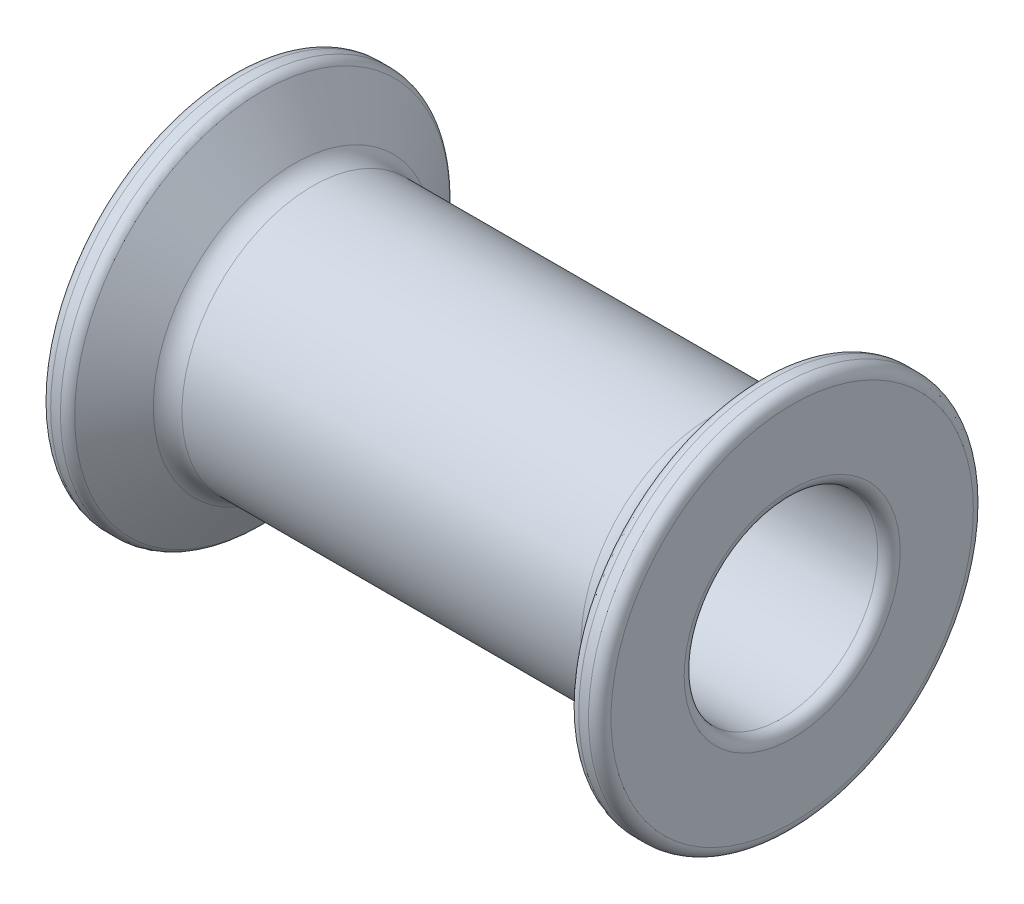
from build123d import *

# Parameters (mm, degrees)
FILLET1_R = 1
FILLET2_R = 0.5


with BuildPart() as part:
    # Sketch1 → Revolve1 (revolve)
    with BuildSketch(Plane.XY, mode=Mode.PRIVATE) as revolve1_sk:
        Polygon((0, 5.8), (-9.4, 5.8), (-11.25, 8.55), (-12.45, 8.55), (-12.45, 4.3), (0, 4.3), align=None)
    revolve1 = revolve(revolve1_sk.sketch.rotate(Axis((0, 0, 0), (-1, 0, 0)), 90), axis=Axis((0, 0, 0), (-1, 0, 0)))

    # Mirror1: Revolve1 across plane
    add(revolve1.mirror(Plane(origin=(0, 4.3, 0), x_dir=(0, 0, 1), z_dir=(1, 0, 0))))

    # Fillet1
    fillet1_edges = [part.edges().sort_by_distance(p)[0] for p in [
        (9.4, 0, 5.8),
        (-9.4, 0, 5.8),
    ]]
    fillet(fillet1_edges, radius=FILLET1_R)

    # Fillet2
    fillet2_edges = [part.edges().sort_by_distance(p)[0] for p in [
        (11.25, 0, 8.55),
        (12.45, 0, 8.55),
        (12.45, 0, 4.3),
        (-12.45, 0, 4.3),
        (-12.45, 0, 8.55),
        (-11.25, 0, 8.55),
    ]]
    fillet(fillet2_edges, radius=FILLET2_R)


solid = part.part
